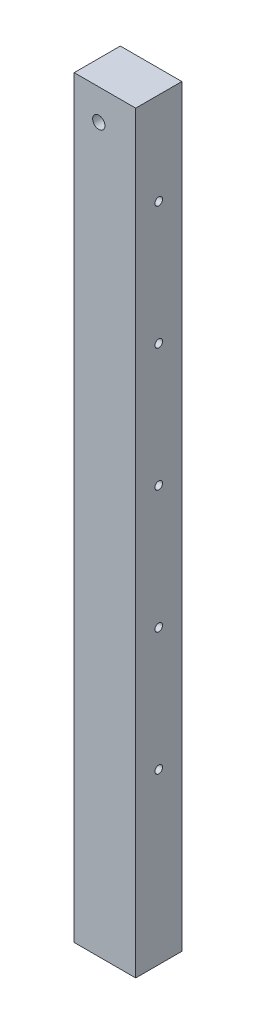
from build123d import *

# Parameters (mm, degrees)
SKETCH_1_W              = 20
SKETCH_1_H              = 15
EXTRUDE_1_DEPTH         = 245
HOLE_WIZARD_2_5_2_5_1_D = 2.5
HOLE_WIZARD_4_0_4_1_D   = 4


with BuildPart() as part:
    # Sketch 1 → Extrude 1 (new body)
    with BuildSketch(Plane(origin=(0, 0, 0), x_dir=(1, 0, 0), z_dir=(0, 1, 0))):
        with Locations((10, 7.5)):
            Rectangle(SKETCH_1_W, SKETCH_1_H)
    extrude(amount=EXTRUDE_1_DEPTH)

    # Hole Wizard 2.5 _2.5_ _1 (through all)
    with Locations(Plane.ZY):
        with Locations((-7.5, 55), (-7.5, 95), (-7.5, 135), (-7.5, 175), (-7.5, 215)):
            Hole(HOLE_WIZARD_2_5_2_5_1_D / 2)

    # Hole Wizard 4.0 _4_ _1 (through all)
    with Locations(Plane.XY):
        with Locations((8, 235), (152, 235)):
            Hole(HOLE_WIZARD_4_0_4_1_D / 2)


solid = part.part
